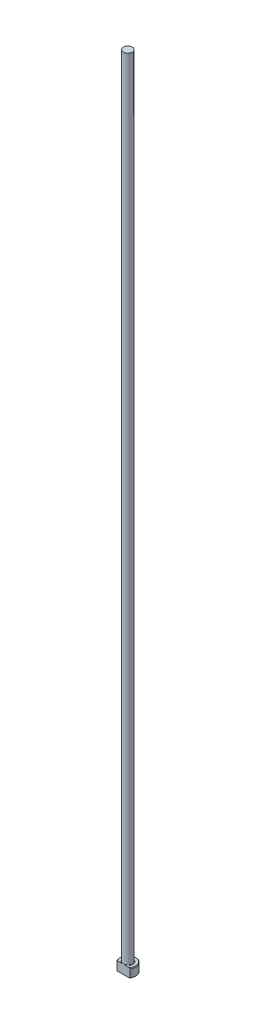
ISO-10303-21;
HEADER;
FILE_DESCRIPTION(('STEP AP214'),'2;1');
FILE_NAME('part.step','',(''),(''),'','','');
FILE_SCHEMA(('AUTOMOTIVE_DESIGN { 1 0 10303 214 1 1 1 1 }'));
ENDSEC;
DATA;
#1=APPLICATION_CONTEXT('core data for automotive mechanical design processes');
#2=APPLICATION_PROTOCOL_DEFINITION('international standard','automotive_design',2000,#1);
#3=PRODUCT_CONTEXT('',#1,'mechanical');
#4=PRODUCT('Part','Part','',(#3));
#5=PRODUCT_RELATED_PRODUCT_CATEGORY('part','',(#4));
#6=PRODUCT_DEFINITION_FORMATION('','',#4);
#7=PRODUCT_DEFINITION_CONTEXT('part definition',#1,'design');
#8=PRODUCT_DEFINITION('design','',#6,#7);
#9=PRODUCT_DEFINITION_SHAPE('','',#8);
#10=(LENGTH_UNIT() NAMED_UNIT(*) SI_UNIT(.MILLI.,.METRE.));
#11=(NAMED_UNIT(*) PLANE_ANGLE_UNIT() SI_UNIT($,.RADIAN.));
#12=(NAMED_UNIT(*) SI_UNIT($,.STERADIAN.) SOLID_ANGLE_UNIT());
#13=UNCERTAINTY_MEASURE_WITH_UNIT(LENGTH_MEASURE(1.E-05),#10,'distance_accuracy_value','');
#14=(GEOMETRIC_REPRESENTATION_CONTEXT(3) GLOBAL_UNCERTAINTY_ASSIGNED_CONTEXT((#13)) GLOBAL_UNIT_ASSIGNED_CONTEXT((#10,
#11,#12)) REPRESENTATION_CONTEXT('',''));
#15=CARTESIAN_POINT('',(0.,0.,0.));
#16=DIRECTION('',(0.,0.,1.));
#17=DIRECTION('',(1.,0.,0.));
#18=AXIS2_PLACEMENT_3D('',#15,#16,#17);
#19=CARTESIAN_POINT('',(0.,0.,0.));
#20=DIRECTION('',(0.,-1.,0.));
#21=DIRECTION('',(0.,0.,-1.));
#22=AXIS2_PLACEMENT_3D('',#19,#20,#21);
#23=PLANE('',#22);
#24=CARTESIAN_POINT('',(0.,0.,0.));
#25=DIRECTION('',(0.,-1.,0.));
#26=DIRECTION('',(0.,0.,-1.));
#27=AXIS2_PLACEMENT_3D('',#24,#25,#26);
#28=CIRCLE('',#27,3.31469999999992);
#29=CARTESIAN_POINT('',(-2.65556240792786,0.,1.98373999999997));
#30=VERTEX_POINT('',#29);
#31=CARTESIAN_POINT('',(2.65556240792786,0.,1.98373999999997));
#32=VERTEX_POINT('',#31);
#33=EDGE_CURVE('E98',#30,#32,#28,.T.);
#34=ORIENTED_EDGE('',*,*,#33,.T.);
#35=DIRECTION('',(-1.,0.,0.));
#36=VECTOR('',#35,1.);
#37=CARTESIAN_POINT('',(-2.96654602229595,0.,1.98373999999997));
#38=LINE('',#37,#36);
#39=EDGE_CURVE('E83',#32,#30,#38,.T.);
#40=ORIENTED_EDGE('',*,*,#39,.T.);
#41=EDGE_LOOP('',(#34,#40));
#42=FACE_BOUND('',#41,.T.);
#43=ADVANCED_FACE('F32',(#42),#23,.T.);
#44=CARTESIAN_POINT('',(0.,259.958771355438,0.));
#45=DIRECTION('',(0.,1.,0.));
#46=DIRECTION('',(0.,0.,1.));
#47=AXIS2_PLACEMENT_3D('',#44,#45,#46);
#48=CYLINDRICAL_SURFACE('',#47,3.56869999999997);
#49=CARTESIAN_POINT('',(0.,3.70839999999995,0.));
#50=DIRECTION('',(0.,1.,0.));
#51=DIRECTION('',(0.,0.,1.));
#52=AXIS2_PLACEMENT_3D('',#49,#50,#51);
#53=CIRCLE('',#52,3.56869999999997);
#54=CARTESIAN_POINT('',(-2.96654602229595,3.70839999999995,1.98373999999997));
#55=VERTEX_POINT('',#54);
#56=CARTESIAN_POINT('',(2.96654602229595,3.70839999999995,1.98373999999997));
#57=VERTEX_POINT('',#56);
#58=EDGE_CURVE('E104',#55,#57,#53,.F.);
#59=ORIENTED_EDGE('',*,*,#58,.T.);
#60=DIRECTION('',(0.,-1.,0.));
#61=VECTOR('',#60,1.);
#62=CARTESIAN_POINT('',(2.96654602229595,355.6,1.98373999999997));
#63=LINE('',#62,#61);
#64=CARTESIAN_POINT('',(2.96654602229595,0.254000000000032,1.98373999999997));
#65=VERTEX_POINT('',#64);
#66=EDGE_CURVE('E183',#57,#65,#63,.T.);
#67=ORIENTED_EDGE('',*,*,#66,.T.);
#68=CARTESIAN_POINT('',(0.,0.254000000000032,0.));
#69=DIRECTION('',(0.,-1.,0.));
#70=DIRECTION('',(0.,0.,-1.));
#71=AXIS2_PLACEMENT_3D('',#68,#69,#70);
#72=CIRCLE('',#71,3.56869999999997);
#73=CARTESIAN_POINT('',(-2.96654602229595,0.254000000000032,1.98373999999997));
#74=VERTEX_POINT('',#73);
#75=EDGE_CURVE('E100',#65,#74,#72,.F.);
#76=ORIENTED_EDGE('',*,*,#75,.T.);
#77=DIRECTION('',(0.,-1.,0.));
#78=VECTOR('',#77,1.);
#79=CARTESIAN_POINT('',(-2.96654602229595,355.6,1.98373999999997));
#80=LINE('',#79,#78);
#81=EDGE_CURVE('E93',#55,#74,#80,.T.);
#82=ORIENTED_EDGE('',*,*,#81,.F.);
#83=EDGE_LOOP('',(#59,#67,#76,#82));
#84=FACE_BOUND('',#83,.T.);
#85=ADVANCED_FACE('F158',(#84),#48,.T.);
#86=CARTESIAN_POINT('',(-3.56869999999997,3.9624,0.));
#87=DIRECTION('',(0.,1.,0.));
#88=DIRECTION('',(0.,0.,1.));
#89=AXIS2_PLACEMENT_3D('',#86,#87,#88);
#90=PLANE('',#89);
#91=CARTESIAN_POINT('',(0.,3.9624,0.));
#92=DIRECTION('',(0.,1.,0.));
#93=DIRECTION('',(0.,0.,1.));
#94=AXIS2_PLACEMENT_3D('',#91,#92,#93);
#95=CIRCLE('',#94,3.31469999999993);
#96=CARTESIAN_POINT('',(2.65556240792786,3.9624,1.98373999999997));
#97=VERTEX_POINT('',#96);
#98=CARTESIAN_POINT('',(-2.65556240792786,3.9624,1.98373999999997));
#99=VERTEX_POINT('',#98);
#100=EDGE_CURVE('E178',#97,#99,#95,.T.);
#101=ORIENTED_EDGE('',*,*,#100,.T.);
#102=DIRECTION('',(1.,0.,0.));
#103=VECTOR('',#102,1.);
#104=CARTESIAN_POINT('',(-3.56869999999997,3.9624,1.98373999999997));
#105=LINE('',#104,#103);
#106=CARTESIAN_POINT('',(-1.03549790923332,3.96240000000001,1.98373999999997));
#107=VERTEX_POINT('',#106);
#108=EDGE_CURVE('E57',#99,#107,#105,.T.);
#109=ORIENTED_EDGE('',*,*,#108,.T.);
#110=CARTESIAN_POINT('',(0.,3.9624,0.));
#111=DIRECTION('',(0.,1.,0.));
#112=DIRECTION('',(0.,0.,1.));
#113=AXIS2_PLACEMENT_3D('',#110,#111,#112);
#114=CIRCLE('',#113,2.23773999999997);
#115=CARTESIAN_POINT('',(1.03549790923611,3.96240000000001,1.98373999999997));
#116=VERTEX_POINT('',#115);
#117=EDGE_CURVE('E107',#107,#116,#114,.F.);
#118=ORIENTED_EDGE('',*,*,#117,.T.);
#119=EDGE_CURVE('E136',#116,#97,#105,.T.);
#120=ORIENTED_EDGE('',*,*,#119,.T.);
#121=EDGE_LOOP('',(#101,#109,#118,#120));
#122=FACE_BOUND('',#121,.T.);
#123=ADVANCED_FACE('F147',(#122),#90,.T.);
#124=CARTESIAN_POINT('',(0.,3.96239999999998,0.));
#125=DIRECTION('',(0.,-1.,0.));
#126=DIRECTION('',(0.,0.,-1.));
#127=AXIS2_PLACEMENT_3D('',#124,#125,#126);
#128=CONICAL_SURFACE('',#127,3.31469999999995,0.785398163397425);
#129=ORIENTED_EDGE('',*,*,#58,.F.);
#130=CARTESIAN_POINT('',(-6.52986193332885,0.452561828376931,1.98373999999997));
#131=CARTESIAN_POINT('',(-6.40873458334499,0.568456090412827,1.98373999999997));
#132=CARTESIAN_POINT('',(-6.28747416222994,0.684211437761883,1.98373999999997));
#133=CARTESIAN_POINT('',(-6.0446316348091,0.915385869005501,1.98373999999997));
#134=CARTESIAN_POINT('',(-5.92304952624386,1.03080495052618,1.98373999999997));
#135=CARTESIAN_POINT('',(-5.55767819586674,1.37652609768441,1.98373999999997));
#136=CARTESIAN_POINT('',(-5.31332530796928,1.60623326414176,1.98373999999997));
#137=CARTESIAN_POINT('',(-4.82149182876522,2.06424424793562,1.98373999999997));
#138=CARTESIAN_POINT('',(-4.574002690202,2.29253892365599,1.98373999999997));
#139=CARTESIAN_POINT('',(-4.200281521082,2.63221766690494,1.98373999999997));
#140=CARTESIAN_POINT('',(-4.07530040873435,2.7449770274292,1.98373999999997));
#141=CARTESIAN_POINT('',(-3.82427385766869,2.96930379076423,1.98373999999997));
#142=CARTESIAN_POINT('',(-3.69822843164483,3.08087120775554,1.98373999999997));
#143=CARTESIAN_POINT('',(-3.44001428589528,3.30660356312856,1.98373999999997));
#144=CARTESIAN_POINT('',(-3.30779329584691,3.42070884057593,1.98373999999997));
#145=CARTESIAN_POINT('',(-3.04138139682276,3.64664156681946,1.98373999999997));
#146=CARTESIAN_POINT('',(-2.90719023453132,3.75846871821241,1.98373999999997));
#147=CARTESIAN_POINT('',(-2.63615830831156,3.97886905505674,1.98373999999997));
#148=CARTESIAN_POINT('',(-2.49931761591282,4.08744232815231,1.98373999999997));
#149=CARTESIAN_POINT('',(-2.22197102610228,4.29979212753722,1.98373999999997));
#150=CARTESIAN_POINT('',(-2.08146612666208,4.40356993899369,1.98373999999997));
#151=CARTESIAN_POINT('',(-1.85886698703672,4.55911967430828,1.98373999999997));
#152=CARTESIAN_POINT('',(-1.77859431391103,4.61348917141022,1.98373999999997));
#153=CARTESIAN_POINT('',(-1.61606314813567,4.71915963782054,1.98373999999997));
#154=CARTESIAN_POINT('',(-1.53380502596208,4.77046117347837,1.98373999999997));
#155=CARTESIAN_POINT('',(-1.36686413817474,4.8689876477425,1.98373999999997));
#156=CARTESIAN_POINT('',(-1.28218169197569,4.91621312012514,1.98373999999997));
#157=CARTESIAN_POINT('',(-1.10999775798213,5.00512382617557,1.98373999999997));
#158=CARTESIAN_POINT('',(-1.0224974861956,5.04681141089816,1.98373999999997));
#159=CARTESIAN_POINT('',(-0.813830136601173,5.13563123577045,1.98373999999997));
#160=CARTESIAN_POINT('',(-0.691323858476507,5.17980224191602,1.98373999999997));
#161=CARTESIAN_POINT('',(-0.503703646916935,5.23128984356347,1.98373999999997));
#162=CARTESIAN_POINT('',(-0.440603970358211,5.24598141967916,1.98373999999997));
#163=CARTESIAN_POINT('',(-0.313367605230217,5.26973239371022,1.98373999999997));
#164=CARTESIAN_POINT('',(-0.249231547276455,5.27879509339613,1.98373999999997));
#165=CARTESIAN_POINT('',(-0.119629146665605,5.29081518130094,1.98373999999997));
#166=CARTESIAN_POINT('',(-0.0541560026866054,5.29370053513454,1.98373999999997));
#167=CARTESIAN_POINT('',(0.0767508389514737,5.2929551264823,1.98373999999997));
#168=CARTESIAN_POINT('',(0.142184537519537,5.28932452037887,1.98373999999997));
#169=CARTESIAN_POINT('',(0.272494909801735,5.27578328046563,1.98373999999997));
#170=CARTESIAN_POINT('',(0.33737050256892,5.26586242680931,1.98373999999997));
#171=CARTESIAN_POINT('',(0.465987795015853,5.24034027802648,1.98373999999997));
#172=CARTESIAN_POINT('',(0.529729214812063,5.22473760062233,1.98373999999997));
#173=CARTESIAN_POINT('',(0.683350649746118,5.18075634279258,1.98373999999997));
#174=CARTESIAN_POINT('',(0.7724818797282,5.14977428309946,1.98373999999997));
#175=CARTESIAN_POINT('',(0.947660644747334,5.08010058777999,1.98373999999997));
#176=CARTESIAN_POINT('',(1.03370599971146,5.04140362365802,1.98373999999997));
#177=CARTESIAN_POINT('',(1.20339709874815,4.95807051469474,1.98373999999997));
#178=CARTESIAN_POINT('',(1.28702792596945,4.91340434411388,1.98373999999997));
#179=CARTESIAN_POINT('',(1.41060260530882,4.84319759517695,1.98373999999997));
#180=CARTESIAN_POINT('',(1.45147639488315,4.81926449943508,1.98373999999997));
#181=CARTESIAN_POINT('',(1.53266103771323,4.77046435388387,1.98373999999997));
#182=CARTESIAN_POINT('',(1.57297191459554,4.74559734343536,1.98373999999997));
#183=CARTESIAN_POINT('',(1.70662848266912,4.66127979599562,1.98373999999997));
#184=CARTESIAN_POINT('',(1.79884137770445,4.60003201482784,1.98373999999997));
#185=CARTESIAN_POINT('',(1.98106576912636,4.47433262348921,1.98373999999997));
#186=CARTESIAN_POINT('',(2.07107672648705,4.40988024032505,1.98373999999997));
#187=CARTESIAN_POINT('',(2.24940000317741,4.27853620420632,1.98373999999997));
#188=CARTESIAN_POINT('',(2.33771098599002,4.21164274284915,1.98373999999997));
#189=CARTESIAN_POINT('',(2.51291571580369,4.07602097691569,1.98373999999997));
#190=CARTESIAN_POINT('',(2.59980937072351,4.00729255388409,1.98373999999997));
#191=CARTESIAN_POINT('',(2.85922047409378,3.79863581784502,1.98373999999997));
#192=CARTESIAN_POINT('',(3.03001914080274,3.65657350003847,1.98373999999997));
#193=CARTESIAN_POINT('',(3.36845974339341,3.36891947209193,1.98373999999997));
#194=CARTESIAN_POINT('',(3.53610304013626,3.22332934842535,1.98373999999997));
#195=CARTESIAN_POINT('',(3.86946040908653,2.92948579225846,1.98373999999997));
#196=CARTESIAN_POINT('',(4.03517138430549,2.78122885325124,1.98373999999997));
#197=CARTESIAN_POINT('',(4.36503284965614,2.48295883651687,1.98373999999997));
#198=CARTESIAN_POINT('',(4.52918317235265,2.33294557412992,1.98373999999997));
#199=CARTESIAN_POINT('',(4.85609064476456,2.03183529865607,1.98373999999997));
#200=CARTESIAN_POINT('',(5.01884932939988,1.88073994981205,1.98373999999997));
#201=CARTESIAN_POINT('',(5.34346533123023,1.57758411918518,1.98373999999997));
#202=CARTESIAN_POINT('',(5.50532264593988,1.42552363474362,1.98373999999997));
#203=CARTESIAN_POINT('',(5.73906525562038,1.20490693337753,1.98373999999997));
#204=CARTESIAN_POINT('',(5.81123331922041,1.13664991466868,1.98373999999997));
#205=CARTESIAN_POINT('',(5.95545466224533,0.99998818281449,1.98373999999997));
#206=CARTESIAN_POINT('',(6.02750791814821,0.93158344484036,1.98373999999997));
#207=CARTESIAN_POINT('',(6.17134461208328,0.794799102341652,1.98373999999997));
#208=CARTESIAN_POINT('',(6.24312829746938,0.72641975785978,1.98373999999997));
#209=CARTESIAN_POINT('',(6.38657767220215,0.589563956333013,1.98373999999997));
#210=CARTESIAN_POINT('',(6.45824338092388,0.521087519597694,1.98373999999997));
#211=CARTESIAN_POINT('',(6.52986193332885,0.452561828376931,1.98373999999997));
#212=B_SPLINE_CURVE_WITH_KNOTS('',3,(#130,#131,#132,#133,#134,#135,#136,#137,#138,#139,#140,
#141,#142,#143,#144,#145,#146,#147,#148,#149,#150,#151,#152,#153,#154,#155,#156,#157,#158,#159,
#160,#161,#162,#163,#164,#165,#166,#167,#168,#169,#170,#171,#172,#173,#174,#175,#176,#177,#178,
#179,#180,#181,#182,#183,#184,#185,#186,#187,#188,#189,#190,#191,#192,#193,#194,#195,#196,#197,
#198,#199,#200,#201,#202,#203,#204,#205,#206,#207,#208,#209,#210,#211),.UNSPECIFIED.,.F.,.F.,(4,
2,2,2,2,2,2,2,2,2,2,2,2,2,2,2,2,2,2,2,2,2,2,2,2,2,2,2,2,2,2,2,2,2,2,2,2,2,2,2,4),(0.,
0.502921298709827,1.00584613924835,2.01195072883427,3.02203392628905,3.52701801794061,
4.03199609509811,4.55592627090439,5.07992441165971,5.60390842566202,6.12775118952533,
6.41855604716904,6.70930705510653,7.00001993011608,7.29060898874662,7.67991368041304,
7.87406585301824,8.06810403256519,8.26439284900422,8.46067695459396,8.65728078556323,
8.85393247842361,9.13651242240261,9.41928821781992,9.70354407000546,9.84563042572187,
9.98771079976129,10.3197055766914,10.651780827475,10.984107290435,11.3164552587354,
11.9828350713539,12.6489205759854,13.3159573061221,13.9830648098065,14.64930423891,
15.3155455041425,15.6135474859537,15.911604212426,16.2090224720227,16.5063857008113),.UNSPECIFIED.);
#213=EDGE_CURVE('E135',#55,#99,#212,.T.);
#214=ORIENTED_EDGE('',*,*,#213,.T.);
#215=ORIENTED_EDGE('',*,*,#100,.F.);
#216=EDGE_CURVE('E127',#97,#57,#212,.T.);
#217=ORIENTED_EDGE('',*,*,#216,.T.);
#218=EDGE_LOOP('',(#129,#214,#215,#217));
#219=FACE_BOUND('',#218,.T.);
#220=ADVANCED_FACE('F143',(#219),#128,.T.);
#221=CARTESIAN_POINT('',(0.,0.254000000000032,0.));
#222=DIRECTION('',(0.,1.,0.));
#223=DIRECTION('',(0.,0.,1.));
#224=AXIS2_PLACEMENT_3D('',#221,#222,#223);
#225=CONICAL_SURFACE('',#224,3.56869999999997,0.78539816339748);
#226=ORIENTED_EDGE('',*,*,#75,.F.);
#227=CARTESIAN_POINT('',(6.52986193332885,3.50983817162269,1.98373999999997));
#228=CARTESIAN_POINT('',(6.40873458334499,3.39394390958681,1.98373999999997));
#229=CARTESIAN_POINT('',(6.28747416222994,3.27818856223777,1.98373999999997));
#230=CARTESIAN_POINT('',(6.04463163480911,3.04701413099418,1.98373999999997));
#231=CARTESIAN_POINT('',(5.92304952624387,2.93159504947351,1.98373999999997));
#232=CARTESIAN_POINT('',(5.55767819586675,2.58587390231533,1.98373999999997));
#233=CARTESIAN_POINT('',(5.3133253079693,2.35616673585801,1.98373999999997));
#234=CARTESIAN_POINT('',(4.82149182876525,1.8981557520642,1.98373999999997));
#235=CARTESIAN_POINT('',(4.57400269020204,1.66986107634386,1.98373999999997));
#236=CARTESIAN_POINT('',(4.20028152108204,1.33018233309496,1.98373999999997));
#237=CARTESIAN_POINT('',(4.07530040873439,1.21742297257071,1.98373999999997));
#238=CARTESIAN_POINT('',(3.82427385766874,0.993096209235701,1.98373999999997));
#239=CARTESIAN_POINT('',(3.69822843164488,0.88152879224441,1.98373999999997));
#240=CARTESIAN_POINT('',(3.4400142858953,0.655796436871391,1.98373999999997));
#241=CARTESIAN_POINT('',(3.3077932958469,0.541691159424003,1.98373999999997));
#242=CARTESIAN_POINT('',(3.04138139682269,0.315758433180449,1.98373999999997));
#243=CARTESIAN_POINT('',(2.90719023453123,0.203931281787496,1.98373999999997));
#244=CARTESIAN_POINT('',(2.6361583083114,-0.0164690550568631,1.98373999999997));
#245=CARTESIAN_POINT('',(2.49931761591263,-0.125042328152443,1.98373999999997));
#246=CARTESIAN_POINT('',(2.22197102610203,-0.337392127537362,1.98373999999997));
#247=CARTESIAN_POINT('',(2.0814661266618,-0.441169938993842,1.98373999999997));
#248=CARTESIAN_POINT('',(1.85886698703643,-0.596719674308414,1.98373999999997));
#249=CARTESIAN_POINT('',(1.77859431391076,-0.651089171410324,1.98373999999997));
#250=CARTESIAN_POINT('',(1.61606314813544,-0.756759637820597,1.98373999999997));
#251=CARTESIAN_POINT('',(1.53380502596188,-0.808061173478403,1.98373999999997));
#252=CARTESIAN_POINT('',(1.36686413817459,-0.906587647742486,1.98373999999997));
#253=CARTESIAN_POINT('',(1.28218169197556,-0.953813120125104,1.98373999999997));
#254=CARTESIAN_POINT('',(1.10999775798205,-1.04272382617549,1.98373999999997));
#255=CARTESIAN_POINT('',(1.02249748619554,-1.08441141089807,1.98373999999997));
#256=CARTESIAN_POINT('',(0.813830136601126,-1.17323123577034,1.98373999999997));
#257=CARTESIAN_POINT('',(0.691323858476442,-1.2174022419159,1.98373999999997));
#258=CARTESIAN_POINT('',(0.503703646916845,-1.26888984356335,1.98373999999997));
#259=CARTESIAN_POINT('',(0.440603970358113,-1.28358141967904,1.98373999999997));
#260=CARTESIAN_POINT('',(0.313367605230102,-1.30733239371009,1.98373999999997));
#261=CARTESIAN_POINT('',(0.249231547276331,-1.316395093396,1.98373999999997));
#262=CARTESIAN_POINT('',(0.119629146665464,-1.3284151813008,1.98373999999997));
#263=CARTESIAN_POINT('',(0.0541560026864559,-1.33130053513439,1.98373999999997));
#264=CARTESIAN_POINT('',(-0.0767508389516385,-1.33055512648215,1.98373999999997));
#265=CARTESIAN_POINT('',(-0.142184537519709,-1.32692452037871,1.98373999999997));
#266=CARTESIAN_POINT('',(-0.272494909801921,-1.31338328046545,1.98373999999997));
#267=CARTESIAN_POINT('',(-0.337370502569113,-1.30346242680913,1.98373999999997));
#268=CARTESIAN_POINT('',(-0.465987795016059,-1.27794027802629,1.98373999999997));
#269=CARTESIAN_POINT('',(-0.529729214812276,-1.26233760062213,1.98373999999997));
#270=CARTESIAN_POINT('',(-0.683350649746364,-1.21835634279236,1.98373999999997));
#271=CARTESIAN_POINT('',(-0.772481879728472,-1.18737428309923,1.98373999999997));
#272=CARTESIAN_POINT('',(-0.947660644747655,-1.11770058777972,1.98373999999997));
#273=CARTESIAN_POINT('',(-1.03370599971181,-1.07900362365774,1.98373999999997));
#274=CARTESIAN_POINT('',(-1.20339709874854,-0.995670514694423,1.98373999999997));
#275=CARTESIAN_POINT('',(-1.28702792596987,-0.951004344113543,1.98373999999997));
#276=CARTESIAN_POINT('',(-1.41060260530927,-0.880797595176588,1.98373999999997));
#277=CARTESIAN_POINT('',(-1.45147639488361,-0.856864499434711,1.98373999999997));
#278=CARTESIAN_POINT('',(-1.53266103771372,-0.808064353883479,1.98373999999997));
#279=CARTESIAN_POINT('',(-1.57297191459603,-0.783197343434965,1.98373999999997));
#280=CARTESIAN_POINT('',(-1.70662848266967,-0.698879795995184,1.98373999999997));
#281=CARTESIAN_POINT('',(-1.79884137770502,-0.637632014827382,1.98373999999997));
#282=CARTESIAN_POINT('',(-1.981065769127,-0.511932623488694,1.98373999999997));
#283=CARTESIAN_POINT('',(-2.07107672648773,-0.447480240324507,1.98373999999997));
#284=CARTESIAN_POINT('',(-2.24940000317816,-0.316136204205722,1.98373999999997));
#285=CARTESIAN_POINT('',(-2.3377109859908,-0.249242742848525,1.98373999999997));
#286=CARTESIAN_POINT('',(-2.51291571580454,-0.113620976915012,1.98373999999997));
#287=CARTESIAN_POINT('',(-2.59980937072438,-0.0448925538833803,1.98373999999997));
#288=CARTESIAN_POINT('',(-2.85922047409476,0.163764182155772,1.98373999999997));
#289=CARTESIAN_POINT('',(-3.03001914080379,0.305826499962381,1.98373999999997));
#290=CARTESIAN_POINT('',(-3.36845974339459,0.59348052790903,1.98373999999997));
#291=CARTESIAN_POINT('',(-3.53610304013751,0.739070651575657,1.98373999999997));
#292=CARTESIAN_POINT('',(-3.86946040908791,1.03291420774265,1.98373999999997));
#293=CARTESIAN_POINT('',(-4.03517138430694,1.18117114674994,1.98373999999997));
#294=CARTESIAN_POINT('',(-4.36503284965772,1.47944116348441,1.98373999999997));
#295=CARTESIAN_POINT('',(-4.52918317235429,1.62945442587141,1.98373999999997));
#296=CARTESIAN_POINT('',(-4.85609064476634,1.93056470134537,1.98373999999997));
#297=CARTESIAN_POINT('',(-5.01884932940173,2.08166005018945,1.98373999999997));
#298=CARTESIAN_POINT('',(-5.34346533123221,2.38481588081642,1.98373999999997));
#299=CARTESIAN_POINT('',(-5.50532264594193,2.53687636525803,1.98373999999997));
#300=CARTESIAN_POINT('',(-5.73906525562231,2.757493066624,1.98373999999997));
#301=CARTESIAN_POINT('',(-5.81123331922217,2.82575008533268,1.98373999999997));
#302=CARTESIAN_POINT('',(-5.95545466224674,2.96241181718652,1.98373999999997));
#303=CARTESIAN_POINT('',(-6.02750791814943,3.03081655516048,1.98373999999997));
#304=CARTESIAN_POINT('',(-6.17134461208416,3.16760089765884,1.98373999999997));
#305=CARTESIAN_POINT('',(-6.24312829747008,3.23598024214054,1.98373999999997));
#306=CARTESIAN_POINT('',(-6.3865776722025,3.37283604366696,1.98373999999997));
#307=CARTESIAN_POINT('',(-6.45824338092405,3.4413124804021,1.98373999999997));
#308=CARTESIAN_POINT('',(-6.52986193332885,3.50983817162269,1.98373999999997));
#309=B_SPLINE_CURVE_WITH_KNOTS('',3,(#227,#228,#229,#230,#231,#232,#233,#234,#235,#236,#237,
#238,#239,#240,#241,#242,#243,#244,#245,#246,#247,#248,#249,#250,#251,#252,#253,#254,#255,#256,
#257,#258,#259,#260,#261,#262,#263,#264,#265,#266,#267,#268,#269,#270,#271,#272,#273,#274,#275,
#276,#277,#278,#279,#280,#281,#282,#283,#284,#285,#286,#287,#288,#289,#290,#291,#292,#293,#294,
#295,#296,#297,#298,#299,#300,#301,#302,#303,#304,#305,#306,#307,#308),.UNSPECIFIED.,.F.,.F.,(4,
2,2,2,2,2,2,2,2,2,2,2,2,2,2,2,2,2,2,2,2,2,2,2,2,2,2,2,2,2,2,2,2,2,2,2,2,2,2,2,4),(0.,
0.502921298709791,1.00584613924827,2.01195072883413,3.02203392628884,3.52701801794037,
4.03199609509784,4.55592627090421,5.07992441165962,5.60390842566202,6.12775118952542,
6.41855604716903,6.70930705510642,7.00001993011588,7.29060898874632,7.6799136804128,
7.87406585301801,8.06810403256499,8.26439284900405,8.4606769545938,8.65728078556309,
8.85393247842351,9.13651242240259,9.41928821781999,9.70354407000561,9.84563042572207,
9.98771079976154,10.3197055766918,10.6517808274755,10.9841072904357,11.3164552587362,
11.9828350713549,12.6489205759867,13.3159573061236,13.9830648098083,14.6493042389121,
15.3155455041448,15.6135474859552,15.9116042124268,16.2090224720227,16.5063857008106),.UNSPECIFIED.);
#310=EDGE_CURVE('E86',#65,#32,#309,.T.);
#311=ORIENTED_EDGE('',*,*,#310,.T.);
#312=ORIENTED_EDGE('',*,*,#33,.F.);
#313=EDGE_CURVE('E89',#30,#74,#309,.T.);
#314=ORIENTED_EDGE('',*,*,#313,.T.);
#315=EDGE_LOOP('',(#226,#311,#312,#314));
#316=FACE_BOUND('',#315,.T.);
#317=ADVANCED_FACE('F97',(#316),#225,.T.);
#318=CARTESIAN_POINT('',(0.,4.21640000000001,0.));
#319=DIRECTION('',(0.,1.,0.));
#320=DIRECTION('',(0.,0.,1.));
#321=AXIS2_PLACEMENT_3D('',#318,#319,#320);
#322=TOROIDAL_SURFACE('',#321,2.23773999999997,0.254);
#323=CARTESIAN_POINT('',(0.,4.21640000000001,1.98373999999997));
#324=CARTESIAN_POINT('',(-4.02307017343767E-11,4.21640057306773,1.98373999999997));
#325=CARTESIAN_POINT('',(1.40828581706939E-07,4.21640114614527,1.98373999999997));
#326=CARTESIAN_POINT('',(5.7339269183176E-07,4.21640224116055,1.98373999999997));
#327=CARTESIAN_POINT('',(8.70731400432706E-07,4.21640276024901,1.98373999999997));
#328=CARTESIAN_POINT('',(1.58225797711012E-06,4.21640380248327,1.98373999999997));
#329=CARTESIAN_POINT('',(2.00604119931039E-06,4.21640431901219,1.98373999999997));
#330=CARTESIAN_POINT('',(2.91133999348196E-06,4.21640528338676,1.98373999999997));
#331=CARTESIAN_POINT('',(3.39207133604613E-06,4.21640573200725,1.98373999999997));
#332=CARTESIAN_POINT('',(5.14628594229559E-06,4.21640727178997,1.98373999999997));
#333=CARTESIAN_POINT('',(6.49332487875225E-06,4.21640828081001,1.98373999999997));
#334=CARTESIAN_POINT('',(9.24843947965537E-06,4.21641004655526,1.98373999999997));
#335=CARTESIAN_POINT('',(1.06506929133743E-05,4.21641081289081,1.98373999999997));
#336=CARTESIAN_POINT('',(1.62369385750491E-05,4.21641377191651,1.98373999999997));
#337=CARTESIAN_POINT('',(2.04997858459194E-05,4.2164158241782,1.98373999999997));
#338=CARTESIAN_POINT('',(2.88176617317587E-05,4.21641910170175,1.98373999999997));
#339=CARTESIAN_POINT('',(3.28481085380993E-05,4.21642039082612,1.98373999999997));
#340=CARTESIAN_POINT('',(5.03242637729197E-05,4.21642599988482,1.98373999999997));
#341=CARTESIAN_POINT('',(6.37475444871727E-05,4.21643035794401,1.98373999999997));
#342=CARTESIAN_POINT('',(8.86866389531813E-05,4.21643721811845,1.98373999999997));
#343=CARTESIAN_POINT('',(0.000100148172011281,4.21643990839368,1.98373999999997));
#344=CARTESIAN_POINT('',(0.000184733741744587,4.21646156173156,1.98373999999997));
#345=CARTESIAN_POINT('',(0.0002551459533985,4.21648964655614,1.98373999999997));
#346=CARTESIAN_POINT('',(0.000530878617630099,4.21659565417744,1.98373999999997));
#347=CARTESIAN_POINT('',(0.000738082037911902,4.21666677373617,1.98373999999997));
#348=CARTESIAN_POINT('',(0.00154925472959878,4.21694925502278,1.98373999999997));
#349=CARTESIAN_POINT('',(0.00215130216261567,4.21716774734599,1.98373999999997));
#350=CARTESIAN_POINT('',(0.00462988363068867,4.21806309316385,1.98373999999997));
#351=CARTESIAN_POINT('',(0.00650853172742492,4.21873189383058,1.98373999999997));
#352=CARTESIAN_POINT('',(0.0303581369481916,4.22722764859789,1.98373999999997));
#353=CARTESIAN_POINT('',(0.0523158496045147,4.23510626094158,1.98373999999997));
#354=CARTESIAN_POINT('',(0.0954269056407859,4.25047917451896,1.98373999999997));
#355=CARTESIAN_POINT('',(0.11657919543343,4.25797672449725,1.98373999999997));
#356=CARTESIAN_POINT('',(0.161458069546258,4.27377445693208,1.98373999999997));
#357=CARTESIAN_POINT('',(0.185188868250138,4.28206294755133,1.98373999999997));
#358=CARTESIAN_POINT('',(0.232964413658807,4.29853259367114,1.98373999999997));
#359=CARTESIAN_POINT('',(0.257009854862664,4.30671173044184,1.98373999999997));
#360=CARTESIAN_POINT('',(0.316193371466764,4.32648112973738,1.98373999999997));
#361=CARTESIAN_POINT('',(0.3513814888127,4.33792303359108,1.98373999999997));
#362=CARTESIAN_POINT('',(0.421152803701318,4.35974103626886,1.98373999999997));
#363=CARTESIAN_POINT('',(0.455729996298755,4.37013624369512,1.98373999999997));
#364=CARTESIAN_POINT('',(0.532487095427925,4.39200885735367,1.98373999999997));
#365=CARTESIAN_POINT('',(0.574734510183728,4.4032531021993,1.98373999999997));
#366=CARTESIAN_POINT('',(0.6600384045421,4.42385016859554,1.98373999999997));
#367=CARTESIAN_POINT('',(0.703098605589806,4.43318780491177,1.98373999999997));
#368=CARTESIAN_POINT('',(0.792838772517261,4.44980860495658,1.98373999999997));
#369=CARTESIAN_POINT('',(0.83955648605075,4.45689590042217,1.98373999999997));
#370=CARTESIAN_POINT('',(0.933305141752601,4.46701113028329,1.98373999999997));
#371=CARTESIAN_POINT('',(0.980334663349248,4.47005158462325,1.98373999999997));
#372=CARTESIAN_POINT('',(1.07363680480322,4.47068781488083,1.98373999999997));
#373=CARTESIAN_POINT('',(1.11990681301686,4.46838602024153,1.98373999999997));
#374=CARTESIAN_POINT('',(1.18820667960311,4.45949572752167,1.98373999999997));
#375=CARTESIAN_POINT('',(1.21059706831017,4.45568261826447,1.98373999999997));
#376=CARTESIAN_POINT('',(1.25489724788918,4.44592513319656,1.98373999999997));
#377=CARTESIAN_POINT('',(1.27680769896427,4.43998390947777,1.98373999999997));
#378=CARTESIAN_POINT('',(1.31298334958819,4.42779727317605,1.98373999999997));
#379=CARTESIAN_POINT('',(1.32747926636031,4.42223947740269,1.98373999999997));
#380=CARTESIAN_POINT('',(1.35590450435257,4.40970381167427,1.98373999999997));
#381=CARTESIAN_POINT('',(1.36983212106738,4.40272199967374,1.98373999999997));
#382=CARTESIAN_POINT('',(1.39685784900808,4.38707849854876,1.98373999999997));
#383=CARTESIAN_POINT('',(1.40994935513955,4.37840521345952,1.98373999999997));
#384=CARTESIAN_POINT('',(1.43467906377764,4.35918713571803,1.98373999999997));
#385=CARTESIAN_POINT('',(1.44632058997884,4.34864676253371,1.98373999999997));
#386=CARTESIAN_POINT('',(1.46405523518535,4.32920735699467,1.98373999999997));
#387=CARTESIAN_POINT('',(1.47073699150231,4.32084820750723,1.98373999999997));
#388=CARTESIAN_POINT('',(1.48274781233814,4.30319678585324,1.98373999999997));
#389=CARTESIAN_POINT('',(1.48807744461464,4.29390490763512,1.98373999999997));
#390=CARTESIAN_POINT('',(1.49706189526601,4.27440249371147,1.98373999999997));
#391=CARTESIAN_POINT('',(1.50069745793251,4.2641829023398,1.98373999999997));
#392=CARTESIAN_POINT('',(1.50584635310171,4.24322268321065,1.98373999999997));
#393=CARTESIAN_POINT('',(1.50736266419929,4.23248280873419,1.98373999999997));
#394=CARTESIAN_POINT('',(1.50805409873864,4.21251978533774,1.98373999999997));
#395=CARTESIAN_POINT('',(1.50754134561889,4.2033063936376,1.98373999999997));
#396=CARTESIAN_POINT('',(1.50490308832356,4.18511471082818,1.98373999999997));
#397=CARTESIAN_POINT('',(1.50277735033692,4.17613645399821,1.98373999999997));
#398=CARTESIAN_POINT('',(1.49719456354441,4.15900798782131,1.98373999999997));
#399=CARTESIAN_POINT('',(1.49379391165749,4.15083904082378,1.98373999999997));
#400=CARTESIAN_POINT('',(1.48586548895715,4.13507450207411,1.98373999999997));
#401=CARTESIAN_POINT('',(1.48133740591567,4.12747906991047,1.98373999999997));
#402=CARTESIAN_POINT('',(1.46862962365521,4.10893969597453,1.98373999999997));
#403=CARTESIAN_POINT('',(1.45980714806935,4.09843603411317,1.98373999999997));
#404=CARTESIAN_POINT('',(1.44060965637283,4.07895123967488,1.98373999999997));
#405=CARTESIAN_POINT('',(1.43023007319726,4.0699747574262,1.98373999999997));
#406=CARTESIAN_POINT('',(1.40223517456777,4.04875837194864,1.98373999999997));
#407=CARTESIAN_POINT('',(1.38384742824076,4.03754372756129,1.98373999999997));
#408=CARTESIAN_POINT('',(1.34565665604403,4.0180221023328,1.98373999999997));
#409=CARTESIAN_POINT('',(1.32585336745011,4.00971566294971,1.98373999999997));
#410=CARTESIAN_POINT('',(1.26986203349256,3.98996652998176,1.98373999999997));
#411=CARTESIAN_POINT('',(1.23279835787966,3.98103330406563,1.98373999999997));
#412=CARTESIAN_POINT('',(1.15741515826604,3.96843140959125,1.98373999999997));
#413=CARTESIAN_POINT('',(1.1190855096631,3.96483389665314,1.98373999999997));
#414=CARTESIAN_POINT('',(1.040510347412,3.96167833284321,1.98373999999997));
#415=CARTESIAN_POINT('',(1.00025822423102,3.96231482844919,1.98373999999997));
#416=CARTESIAN_POINT('',(0.919878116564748,3.96702722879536,1.98373999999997));
#417=CARTESIAN_POINT('',(0.879750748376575,3.97111229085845,1.98373999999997));
#418=CARTESIAN_POINT('',(0.802049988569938,3.98166551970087,1.98373999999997));
#419=CARTESIAN_POINT('',(0.764456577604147,3.98799169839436,1.98373999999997));
#420=CARTESIAN_POINT('',(0.689886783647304,4.00249311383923,1.98373999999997));
#421=CARTESIAN_POINT('',(0.652907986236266,4.0106561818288,1.98373999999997));
#422=CARTESIAN_POINT('',(0.571827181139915,4.03026785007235,1.98373999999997));
#423=CARTESIAN_POINT('',(0.527806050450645,4.04204700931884,1.98373999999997));
#424=CARTESIAN_POINT('',(0.439166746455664,4.06747597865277,1.98373999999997));
#425=CARTESIAN_POINT('',(0.394559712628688,4.08116399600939,1.98373999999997));
#426=CARTESIAN_POINT('',(0.319865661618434,4.10513097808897,1.98373999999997));
#427=CARTESIAN_POINT('',(0.28968006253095,4.11510679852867,1.98373999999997));
#428=CARTESIAN_POINT('',(0.229752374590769,4.1353375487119,1.98373999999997));
#429=CARTESIAN_POINT('',(0.200008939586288,4.14558849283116,1.98373999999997));
#430=CARTESIAN_POINT('',(0.143797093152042,4.16520591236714,1.98373999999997));
#431=CARTESIAN_POINT('',(0.117320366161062,4.17454899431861,1.98373999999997));
#432=CARTESIAN_POINT('',(0.0633624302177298,4.19374573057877,1.98373999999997));
#433=CARTESIAN_POINT('',(0.0358830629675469,4.20360493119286,1.98373999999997));
#434=CARTESIAN_POINT('',(0.00650762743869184,4.21406838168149,1.98373999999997));
#435=CARTESIAN_POINT('',(0.00462809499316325,4.21473753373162,1.98373999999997));
#436=CARTESIAN_POINT('',(0.00214930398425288,4.21563296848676,1.98373999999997));
#437=CARTESIAN_POINT('',(0.00154793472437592,4.21585121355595,1.98373999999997));
#438=CARTESIAN_POINT('',(0.000737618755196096,4.21613339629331,1.98373999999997));
#439=CARTESIAN_POINT('',(0.000530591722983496,4.21620445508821,1.98373999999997));
#440=CARTESIAN_POINT('',(0.000255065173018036,4.21631038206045,1.98373999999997));
#441=CARTESIAN_POINT('',(0.000184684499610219,4.21633845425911,1.98373999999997));
#442=CARTESIAN_POINT('',(0.000100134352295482,4.21636010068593,1.98373999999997));
#443=CARTESIAN_POINT('',(8.86750306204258E-05,4.21636279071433,1.98373999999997));
#444=CARTESIAN_POINT('',(6.37408791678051E-05,4.2163696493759,1.98373999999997));
#445=CARTESIAN_POINT('',(5.03202712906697E-05,4.21637400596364,1.98373999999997));
#446=CARTESIAN_POINT('',(3.2847107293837E-05,4.21637961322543,1.98373999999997));
#447=CARTESIAN_POINT('',(2.88169884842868E-05,4.21638090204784,1.98373999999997));
#448=CARTESIAN_POINT('',(2.04997436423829E-05,4.21638417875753,1.98373999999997));
#449=CARTESIAN_POINT('',(1.62371861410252E-05,4.21638623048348,1.98373999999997));
#450=CARTESIAN_POINT('',(1.06512202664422E-05,4.21638918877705,1.98373999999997));
#451=CARTESIAN_POINT('',(9.24899206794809E-06,4.21638995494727,1.98373999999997));
#452=CARTESIAN_POINT('',(6.49389610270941E-06,4.21639172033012,1.98373999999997));
#453=CARTESIAN_POINT('',(5.14684846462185E-06,4.21639272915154,1.98373999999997));
#454=CARTESIAN_POINT('',(3.39258419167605E-06,4.21639426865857,1.98373999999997));
#455=CARTESIAN_POINT('',(2.91183082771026E-06,4.21639471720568,1.98373999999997));
#456=CARTESIAN_POINT('',(2.00647479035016E-06,4.21639568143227,1.98373999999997));
#457=CARTESIAN_POINT('',(1.5826561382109E-06,4.21639619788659,1.98373999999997));
#458=CARTESIAN_POINT('',(8.71044273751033E-07,4.21639723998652,1.98373999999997));
#459=CARTESIAN_POINT('',(5.73657832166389E-07,4.21639775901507,1.98373999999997));
#460=CARTESIAN_POINT('',(1.40976930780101E-07,4.21639885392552,1.98373999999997));
#461=CARTESIAN_POINT('',(4.02289072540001E-11,4.21639942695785,1.98373999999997));
#462=CARTESIAN_POINT('',(0.,4.21640000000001,1.98373999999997));
#463=B_SPLINE_CURVE_WITH_KNOTS('',3,(#323,#324,#325,#326,#327,#328,#329,#330,#331,#332,#333,
#334,#335,#336,#337,#338,#339,#340,#341,#342,#343,#344,#345,#346,#347,#348,#349,#350,#351,#352,
#353,#354,#355,#356,#357,#358,#359,#360,#361,#362,#363,#364,#365,#366,#367,#368,#369,#370,#371,
#372,#373,#374,#375,#376,#377,#378,#379,#380,#381,#382,#383,#384,#385,#386,#387,#388,#389,#390,
#391,#392,#393,#394,#395,#396,#397,#398,#399,#400,#401,#402,#403,#404,#405,#406,#407,#408,#409,
#410,#411,#412,#413,#414,#415,#416,#417,#418,#419,#420,#421,#422,#423,#424,#425,#426,#427,#428,
#429,#430,#431,#432,#433,#434,#435,#436,#437,#438,#439,#440,#441,#442,#443,#444,#445,#446,#447,
#448,#449,#450,#451,#452,#453,#454,#455,#456,#457,#458,#459,#460,#461,#462),.UNSPECIFIED.,.T.,
.F.,(4,2,2,2,2,2,2,2,2,2,2,2,2,2,2,2,2,2,2,2,2,2,2,2,2,2,2,2,2,2,2,2,2,2,2,2,2,2,2,2,2,2,2,2,2,
2,2,2,2,2,2,2,2,2,2,2,2,2,2,2,2,2,2,2,2,2,2,2,2,4),(0.,1.71984197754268E-06,3.5064557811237E-06,
5.50188707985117E-06,7.47248185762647E-06,1.24982124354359E-05,1.7288326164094E-05,
3.14431062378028E-05,4.41239559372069E-05,8.64578801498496E-05,0.000121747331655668,
0.000348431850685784,0.00100625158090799,0.00292688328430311,0.00891015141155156,
0.0788889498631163,0.146215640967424,0.221624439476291,0.297819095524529,0.408816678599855,
0.517124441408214,0.64824249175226,0.780367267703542,0.921987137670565,1.06316784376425,
1.20166404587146,1.26972615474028,1.33768786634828,1.38420339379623,1.4308494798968,
1.47782736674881,1.5246955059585,1.55669718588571,1.58868540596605,1.62102884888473,
1.65332678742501,1.68086440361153,1.70840601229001,1.73485066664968,1.76130265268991,
1.80222010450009,1.84326000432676,1.90750875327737,1.97176945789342,2.08550754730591,
2.2007491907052,2.32132144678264,2.4422148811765,2.55652068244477,2.67009044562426,
2.80675839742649,2.946716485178,3.04208779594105,3.13646648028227,3.2206986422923,
3.30827404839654,3.31426016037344,3.31617862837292,3.31683588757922,3.31706247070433,
3.31709775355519,3.31714007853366,3.31715275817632,3.31716691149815,3.31717170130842,
3.31717672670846,3.31717869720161,3.31718069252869,3.31718247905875,3.31718419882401),.UNSPECIFIED.);
#464=CARTESIAN_POINT('',(0.,4.21640000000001,1.98373999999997));
#465=VERTEX_POINT('',#464);
#466=EDGE_CURVE('E11',#116,#465,#463,.T.);
#467=ORIENTED_EDGE('',*,*,#466,.F.);
#468=ORIENTED_EDGE('',*,*,#117,.F.);
#469=CARTESIAN_POINT('',(0.,4.21640000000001,1.98373999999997));
#470=CARTESIAN_POINT('',(4.02307140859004E-11,4.21639942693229,1.98373999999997));
#471=CARTESIAN_POINT('',(-1.40828581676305E-07,4.21639885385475,1.98373999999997));
#472=CARTESIAN_POINT('',(-5.73392691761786E-07,4.21639775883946,1.98373999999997));
#473=CARTESIAN_POINT('',(-8.70731400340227E-07,4.21639723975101,1.98373999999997));
#474=CARTESIAN_POINT('',(-1.58225797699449E-06,4.21639619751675,1.98373999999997));
#475=CARTESIAN_POINT('',(-2.00604119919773E-06,4.21639568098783,1.98373999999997));
#476=CARTESIAN_POINT('',(-2.91133999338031E-06,4.21639471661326,1.98373999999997));
#477=CARTESIAN_POINT('',(-3.39207133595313E-06,4.21639426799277,1.98373999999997));
#478=CARTESIAN_POINT('',(-5.14628594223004E-06,4.21639272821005,1.98373999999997));
#479=CARTESIAN_POINT('',(-6.49332487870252E-06,4.21639171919,1.98373999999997));
#480=CARTESIAN_POINT('',(-9.24843947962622E-06,4.21638995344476,1.98373999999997));
#481=CARTESIAN_POINT('',(-1.06506929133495E-05,4.21638918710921,1.98373999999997));
#482=CARTESIAN_POINT('',(-1.62369385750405E-05,4.21638622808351,1.98373999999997));
#483=CARTESIAN_POINT('',(-2.04997858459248E-05,4.21638417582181,1.98373999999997));
#484=CARTESIAN_POINT('',(-2.88176617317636E-05,4.21638089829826,1.98373999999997));
#485=CARTESIAN_POINT('',(-3.28481085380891E-05,4.2163796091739,1.98373999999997));
#486=CARTESIAN_POINT('',(-5.03242637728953E-05,4.2163740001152,1.98373999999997));
#487=CARTESIAN_POINT('',(-6.37475444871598E-05,4.216369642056,1.98373999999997));
#488=CARTESIAN_POINT('',(-8.86866389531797E-05,4.21636278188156,1.98373999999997));
#489=CARTESIAN_POINT('',(-0.00010014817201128,4.21636009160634,1.98373999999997));
#490=CARTESIAN_POINT('',(-0.000184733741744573,4.21633843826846,1.98373999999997));
#491=CARTESIAN_POINT('',(-0.000255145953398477,4.21631035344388,1.98373999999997));
#492=CARTESIAN_POINT('',(-0.000530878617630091,4.21620434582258,1.98373999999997));
#493=CARTESIAN_POINT('',(-0.000738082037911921,4.21613322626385,1.98373999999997));
#494=CARTESIAN_POINT('',(-0.00154925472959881,4.21585074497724,1.98373999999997));
#495=CARTESIAN_POINT('',(-0.00215130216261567,4.21563225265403,1.98373999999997));
#496=CARTESIAN_POINT('',(-0.00462988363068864,4.21473690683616,1.98373999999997));
#497=CARTESIAN_POINT('',(-0.0065085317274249,4.21406810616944,1.98373999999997));
#498=CARTESIAN_POINT('',(-0.0303581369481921,4.20557235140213,1.98373999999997));
#499=CARTESIAN_POINT('',(-0.0523158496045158,4.19769373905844,1.98373999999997));
#500=CARTESIAN_POINT('',(-0.0954269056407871,4.18232082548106,1.98373999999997));
#501=CARTESIAN_POINT('',(-0.116579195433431,4.17482327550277,1.98373999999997));
#502=CARTESIAN_POINT('',(-0.161458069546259,4.15902554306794,1.98373999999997));
#503=CARTESIAN_POINT('',(-0.185188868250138,4.15073705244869,1.98373999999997));
#504=CARTESIAN_POINT('',(-0.232964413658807,4.13426740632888,1.98373999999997));
#505=CARTESIAN_POINT('',(-0.257009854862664,4.12608826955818,1.98373999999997));
#506=CARTESIAN_POINT('',(-0.316193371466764,4.10631887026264,1.98373999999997));
#507=CARTESIAN_POINT('',(-0.3513814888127,4.09487696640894,1.98373999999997));
#508=CARTESIAN_POINT('',(-0.421152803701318,4.07305896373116,1.98373999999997));
#509=CARTESIAN_POINT('',(-0.455729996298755,4.06266375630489,1.98373999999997));
#510=CARTESIAN_POINT('',(-0.532487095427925,4.04079114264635,1.98373999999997));
#511=CARTESIAN_POINT('',(-0.574734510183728,4.02954689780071,1.98373999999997));
#512=CARTESIAN_POINT('',(-0.660038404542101,4.00894983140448,1.98373999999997));
#513=CARTESIAN_POINT('',(-0.703098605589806,3.99961219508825,1.98373999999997));
#514=CARTESIAN_POINT('',(-0.792838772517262,3.98299139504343,1.98373999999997));
#515=CARTESIAN_POINT('',(-0.83955648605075,3.97590409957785,1.98373999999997));
#516=CARTESIAN_POINT('',(-0.933305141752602,3.96578886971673,1.98373999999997));
#517=CARTESIAN_POINT('',(-0.980334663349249,3.96274841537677,1.98373999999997));
#518=CARTESIAN_POINT('',(-1.07363680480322,3.96211218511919,1.98373999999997));
#519=CARTESIAN_POINT('',(-1.11990681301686,3.96441397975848,1.98373999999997));
#520=CARTESIAN_POINT('',(-1.18820667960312,3.97330427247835,1.98373999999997));
#521=CARTESIAN_POINT('',(-1.21059706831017,3.97711738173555,1.98373999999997));
#522=CARTESIAN_POINT('',(-1.25489724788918,3.98687486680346,1.98373999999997));
#523=CARTESIAN_POINT('',(-1.27680769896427,3.99281609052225,1.98373999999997));
#524=CARTESIAN_POINT('',(-1.31298334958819,4.00500272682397,1.98373999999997));
#525=CARTESIAN_POINT('',(-1.32747926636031,4.01056052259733,1.98373999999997));
#526=CARTESIAN_POINT('',(-1.35590450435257,4.02309618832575,1.98373999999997));
#527=CARTESIAN_POINT('',(-1.36983212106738,4.03007800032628,1.98373999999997));
#528=CARTESIAN_POINT('',(-1.39685784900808,4.04572150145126,1.98373999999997));
#529=CARTESIAN_POINT('',(-1.40994935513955,4.05439478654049,1.98373999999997));
#530=CARTESIAN_POINT('',(-1.43467906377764,4.07361286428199,1.98373999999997));
#531=CARTESIAN_POINT('',(-1.44632058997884,4.08415323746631,1.98373999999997));
#532=CARTESIAN_POINT('',(-1.46405523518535,4.10359264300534,1.98373999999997));
#533=CARTESIAN_POINT('',(-1.47073699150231,4.11195179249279,1.98373999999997));
#534=CARTESIAN_POINT('',(-1.48274781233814,4.12960321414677,1.98373999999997));
#535=CARTESIAN_POINT('',(-1.48807744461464,4.1388950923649,1.98373999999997));
#536=CARTESIAN_POINT('',(-1.49706189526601,4.15839750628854,1.98373999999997));
#537=CARTESIAN_POINT('',(-1.50069745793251,4.16861709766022,1.98373999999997));
#538=CARTESIAN_POINT('',(-1.50584635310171,4.18957731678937,1.98373999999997));
#539=CARTESIAN_POINT('',(-1.50736266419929,4.20031719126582,1.98373999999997));
#540=CARTESIAN_POINT('',(-1.50805409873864,4.22028021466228,1.98373999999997));
#541=CARTESIAN_POINT('',(-1.50754134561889,4.22949360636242,1.98373999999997));
#542=CARTESIAN_POINT('',(-1.50490308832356,4.24768528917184,1.98373999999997));
#543=CARTESIAN_POINT('',(-1.50277735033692,4.25666354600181,1.98373999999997));
#544=CARTESIAN_POINT('',(-1.49719456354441,4.27379201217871,1.98373999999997));
#545=CARTESIAN_POINT('',(-1.49379391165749,4.28196095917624,1.98373999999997));
#546=CARTESIAN_POINT('',(-1.48586548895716,4.2977254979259,1.98373999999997));
#547=CARTESIAN_POINT('',(-1.48133740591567,4.30532093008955,1.98373999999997));
#548=CARTESIAN_POINT('',(-1.46862962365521,4.32386030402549,1.98373999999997));
#549=CARTESIAN_POINT('',(-1.45980714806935,4.33436396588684,1.98373999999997));
#550=CARTESIAN_POINT('',(-1.44060965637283,4.35384876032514,1.98373999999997));
#551=CARTESIAN_POINT('',(-1.43023007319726,4.36282524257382,1.98373999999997));
#552=CARTESIAN_POINT('',(-1.40223517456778,4.38404162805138,1.98373999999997));
#553=CARTESIAN_POINT('',(-1.38384742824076,4.39525627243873,1.98373999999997));
#554=CARTESIAN_POINT('',(-1.34565665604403,4.41477789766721,1.98373999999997));
#555=CARTESIAN_POINT('',(-1.32585336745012,4.4230843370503,1.98373999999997));
#556=CARTESIAN_POINT('',(-1.26986203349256,4.44283347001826,1.98373999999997));
#557=CARTESIAN_POINT('',(-1.23279835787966,4.45176669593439,1.98373999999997));
#558=CARTESIAN_POINT('',(-1.15741515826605,4.46436859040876,1.98373999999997));
#559=CARTESIAN_POINT('',(-1.1190855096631,4.46796610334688,1.98373999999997));
#560=CARTESIAN_POINT('',(-1.04051034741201,4.4711216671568,1.98373999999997));
#561=CARTESIAN_POINT('',(-1.00025822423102,4.47048517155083,1.98373999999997));
#562=CARTESIAN_POINT('',(-0.919878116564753,4.46577277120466,1.98373999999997));
#563=CARTESIAN_POINT('',(-0.879750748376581,4.46168770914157,1.98373999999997));
#564=CARTESIAN_POINT('',(-0.802049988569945,4.45113448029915,1.98373999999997));
#565=CARTESIAN_POINT('',(-0.764456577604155,4.44480830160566,1.98373999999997));
#566=CARTESIAN_POINT('',(-0.689886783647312,4.43030688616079,1.98373999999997));
#567=CARTESIAN_POINT('',(-0.652907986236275,4.42214381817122,1.98373999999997));
#568=CARTESIAN_POINT('',(-0.571827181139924,4.40253214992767,1.98373999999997));
#569=CARTESIAN_POINT('',(-0.527806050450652,4.39075299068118,1.98373999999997));
#570=CARTESIAN_POINT('',(-0.43916674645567,4.36532402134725,1.98373999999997));
#571=CARTESIAN_POINT('',(-0.394559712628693,4.35163600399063,1.98373999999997));
#572=CARTESIAN_POINT('',(-0.319865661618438,4.32766902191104,1.98373999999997));
#573=CARTESIAN_POINT('',(-0.289680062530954,4.31769320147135,1.98373999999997));
#574=CARTESIAN_POINT('',(-0.229752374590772,4.29746245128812,1.98373999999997));
#575=CARTESIAN_POINT('',(-0.20000893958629,4.28721150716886,1.98373999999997));
#576=CARTESIAN_POINT('',(-0.143797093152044,4.26759408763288,1.98373999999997));
#577=CARTESIAN_POINT('',(-0.117320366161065,4.2582510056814,1.98373999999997));
#578=CARTESIAN_POINT('',(-0.06336243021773,4.23905426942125,1.98373999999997));
#579=CARTESIAN_POINT('',(-0.0358830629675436,4.22919506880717,1.98373999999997));
#580=CARTESIAN_POINT('',(-0.00650762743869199,4.21873161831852,1.98373999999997));
#581=CARTESIAN_POINT('',(-0.00462809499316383,4.2180624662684,1.98373999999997));
#582=CARTESIAN_POINT('',(-0.00214930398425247,4.21716703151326,1.98373999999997));
#583=CARTESIAN_POINT('',(-0.00154793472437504,4.21694878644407,1.98373999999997));
#584=CARTESIAN_POINT('',(-0.000737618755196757,4.21666660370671,1.98373999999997));
#585=CARTESIAN_POINT('',(-0.00053059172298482,4.2165955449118,1.98373999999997));
#586=CARTESIAN_POINT('',(-0.000255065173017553,4.21648961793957,1.98373999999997));
#587=CARTESIAN_POINT('',(-0.000184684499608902,4.21646154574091,1.98373999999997));
#588=CARTESIAN_POINT('',(-0.000100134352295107,4.21643989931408,1.98373999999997));
#589=CARTESIAN_POINT('',(-8.86750306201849E-05,4.21643720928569,1.98373999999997));
#590=CARTESIAN_POINT('',(-6.37408791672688E-05,4.21643035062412,1.98373999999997));
#591=CARTESIAN_POINT('',(-5.03202712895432E-05,4.21642599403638,1.98373999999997));
#592=CARTESIAN_POINT('',(-3.28471072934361E-05,4.21642038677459,1.98373999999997));
#593=CARTESIAN_POINT('',(-2.88169884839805E-05,4.21641909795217,1.98373999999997));
#594=CARTESIAN_POINT('',(-2.04997436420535E-05,4.21641582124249,1.98373999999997));
#595=CARTESIAN_POINT('',(-1.62371861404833E-05,4.21641376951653,1.98373999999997));
#596=CARTESIAN_POINT('',(-1.06512202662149E-05,4.21641081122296,1.98373999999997));
#597=CARTESIAN_POINT('',(-9.24899206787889E-06,4.21641004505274,1.98373999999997));
#598=CARTESIAN_POINT('',(-6.49389610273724E-06,4.2164082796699,1.98373999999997));
#599=CARTESIAN_POINT('',(-5.14684846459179E-06,4.21640727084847,1.98373999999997));
#600=CARTESIAN_POINT('',(-3.39258419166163E-06,4.21640573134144,1.98373999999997));
#601=CARTESIAN_POINT('',(-2.91183082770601E-06,4.21640528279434,1.98373999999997));
#602=CARTESIAN_POINT('',(-2.00647479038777E-06,4.21640431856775,1.98373999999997));
#603=CARTESIAN_POINT('',(-1.58265613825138E-06,4.21640380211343,1.98373999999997));
#604=CARTESIAN_POINT('',(-8.71044273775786E-07,4.2164027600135,1.98373999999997));
#605=CARTESIAN_POINT('',(-5.73657832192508E-07,4.21640224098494,1.98373999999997));
#606=CARTESIAN_POINT('',(-1.40976930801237E-07,4.2164011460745,1.98373999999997));
#607=CARTESIAN_POINT('',(-4.02289196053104E-11,4.21640057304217,1.98373999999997));
#608=CARTESIAN_POINT('',(0.,4.21640000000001,1.98373999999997));
#609=B_SPLINE_CURVE_WITH_KNOTS('',3,(#469,#470,#471,#472,#473,#474,#475,#476,#477,#478,#479,
#480,#481,#482,#483,#484,#485,#486,#487,#488,#489,#490,#491,#492,#493,#494,#495,#496,#497,#498,
#499,#500,#501,#502,#503,#504,#505,#506,#507,#508,#509,#510,#511,#512,#513,#514,#515,#516,#517,
#518,#519,#520,#521,#522,#523,#524,#525,#526,#527,#528,#529,#530,#531,#532,#533,#534,#535,#536,
#537,#538,#539,#540,#541,#542,#543,#544,#545,#546,#547,#548,#549,#550,#551,#552,#553,#554,#555,
#556,#557,#558,#559,#560,#561,#562,#563,#564,#565,#566,#567,#568,#569,#570,#571,#572,#573,#574,
#575,#576,#577,#578,#579,#580,#581,#582,#583,#584,#585,#586,#587,#588,#589,#590,#591,#592,#593,
#594,#595,#596,#597,#598,#599,#600,#601,#602,#603,#604,#605,#606,#607,#608),.UNSPECIFIED.,.T.,
.F.,(4,2,2,2,2,2,2,2,2,2,2,2,2,2,2,2,2,2,2,2,2,2,2,2,2,2,2,2,2,2,2,2,2,2,2,2,2,2,2,2,2,2,2,2,2,
2,2,2,2,2,2,2,2,2,2,2,2,2,2,2,2,2,2,2,2,2,2,2,2,4),(0.,1.71984197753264E-06,
3.50645578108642E-06,5.50188707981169E-06,7.47248185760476E-06,1.24982124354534E-05,
1.7288326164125E-05,3.14431062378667E-05,4.41239559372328E-05,8.64578801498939E-05,
0.000121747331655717,0.000348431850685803,0.00100625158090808,0.00292688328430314,
0.00891015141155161,0.0788889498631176,0.146215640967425,0.221624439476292,0.297819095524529,
0.408816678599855,0.517124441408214,0.64824249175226,0.780367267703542,0.921987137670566,
1.06316784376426,1.20166404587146,1.26972615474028,1.33768786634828,1.38420339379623,
1.4308494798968,1.47782736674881,1.5246955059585,1.55669718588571,1.58868540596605,
1.62102884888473,1.65332678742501,1.68086440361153,1.70840601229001,1.73485066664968,
1.76130265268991,1.80222010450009,1.84326000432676,1.90750875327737,1.97176945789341,
2.08550754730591,2.2007491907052,2.32132144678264,2.44221488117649,2.55652068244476,
2.67009044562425,2.80675839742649,2.946716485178,3.04208779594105,3.13646648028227,
3.22069864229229,3.30827404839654,3.31426016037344,3.31617862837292,3.31683588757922,
3.31706247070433,3.31709775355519,3.31714007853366,3.31715275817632,3.31716691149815,
3.31717170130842,3.31717672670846,3.31717869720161,3.31718069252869,3.31718247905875,
3.31718419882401),.UNSPECIFIED.);
#610=EDGE_CURVE('E46',#465,#107,#609,.T.);
#611=ORIENTED_EDGE('',*,*,#610,.F.);
#612=CARTESIAN_POINT('',(0.,4.21640000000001,0.));
#613=DIRECTION('',(0.,1.,0.));
#614=DIRECTION('',(0.,0.,1.));
#615=AXIS2_PLACEMENT_3D('',#612,#613,#614);
#616=CIRCLE('',#615,1.98373999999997);
#617=EDGE_CURVE('E103',#465,#465,#616,.T.);
#618=ORIENTED_EDGE('',*,*,#617,.F.);
#619=EDGE_LOOP('',(#467,#468,#611,#618));
#620=FACE_BOUND('',#619,.T.);
#621=ADVANCED_FACE('F34',(#620),#322,.F.);
#622=CARTESIAN_POINT('',(0.,259.958771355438,0.));
#623=DIRECTION('',(0.,1.,0.));
#624=DIRECTION('',(0.,0.,1.));
#625=AXIS2_PLACEMENT_3D('',#622,#623,#624);
#626=CYLINDRICAL_SURFACE('',#625,1.98373999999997);
#627=ORIENTED_EDGE('',*,*,#617,.T.);
#628=EDGE_LOOP('',(#627));
#629=FACE_BOUND('',#628,.T.);
#630=CARTESIAN_POINT('',(0.,355.6,0.));
#631=DIRECTION('',(0.,1.,0.));
#632=DIRECTION('',(0.,0.,1.));
#633=AXIS2_PLACEMENT_3D('',#630,#631,#632);
#634=CIRCLE('',#633,1.98373999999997);
#635=CARTESIAN_POINT('',(0.,355.6,1.98373999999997));
#636=VERTEX_POINT('',#635);
#637=EDGE_CURVE('E101',#636,#636,#634,.T.);
#638=ORIENTED_EDGE('',*,*,#637,.F.);
#639=EDGE_LOOP('',(#638));
#640=FACE_BOUND('',#639,.T.);
#641=ADVANCED_FACE('F155',(#629,#640),#626,.T.);
#642=CARTESIAN_POINT('',(-1.98373999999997,355.6,0.));
#643=DIRECTION('',(0.,1.,0.));
#644=DIRECTION('',(0.,0.,1.));
#645=AXIS2_PLACEMENT_3D('',#642,#643,#644);
#646=PLANE('',#645);
#647=ORIENTED_EDGE('',*,*,#637,.T.);
#648=EDGE_LOOP('',(#647));
#649=FACE_BOUND('',#648,.T.);
#650=ADVANCED_FACE('F121',(#649),#646,.T.);
#651=CARTESIAN_POINT('',(-2.96654602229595,355.6,1.98373999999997));
#652=DIRECTION('',(0.,0.,1.));
#653=DIRECTION('',(1.,0.,0.));
#654=AXIS2_PLACEMENT_3D('',#651,#652,#653);
#655=PLANE('',#654);
#656=ORIENTED_EDGE('',*,*,#66,.F.);
#657=ORIENTED_EDGE('',*,*,#216,.F.);
#658=ORIENTED_EDGE('',*,*,#119,.F.);
#659=ORIENTED_EDGE('',*,*,#466,.T.);
#660=ORIENTED_EDGE('',*,*,#610,.T.);
#661=ORIENTED_EDGE('',*,*,#108,.F.);
#662=ORIENTED_EDGE('',*,*,#213,.F.);
#663=ORIENTED_EDGE('',*,*,#81,.T.);
#664=ORIENTED_EDGE('',*,*,#313,.F.);
#665=ORIENTED_EDGE('',*,*,#39,.F.);
#666=ORIENTED_EDGE('',*,*,#310,.F.);
#667=EDGE_LOOP('',(#656,#657,#658,#659,#660,#661,#662,#663,#664,#665,#666));
#668=FACE_BOUND('',#667,.T.);
#669=ADVANCED_FACE('F85',(#668),#655,.T.);
#670=CLOSED_SHELL('',(#43,#85,#123,#220,#317,#621,#641,#650,#669));
#671=MANIFOLD_SOLID_BREP('B2',#670);
#672=ADVANCED_BREP_SHAPE_REPRESENTATION('',(#18,#671),#14);
#673=SHAPE_DEFINITION_REPRESENTATION(#9,#672);
ENDSEC;
END-ISO-10303-21;
